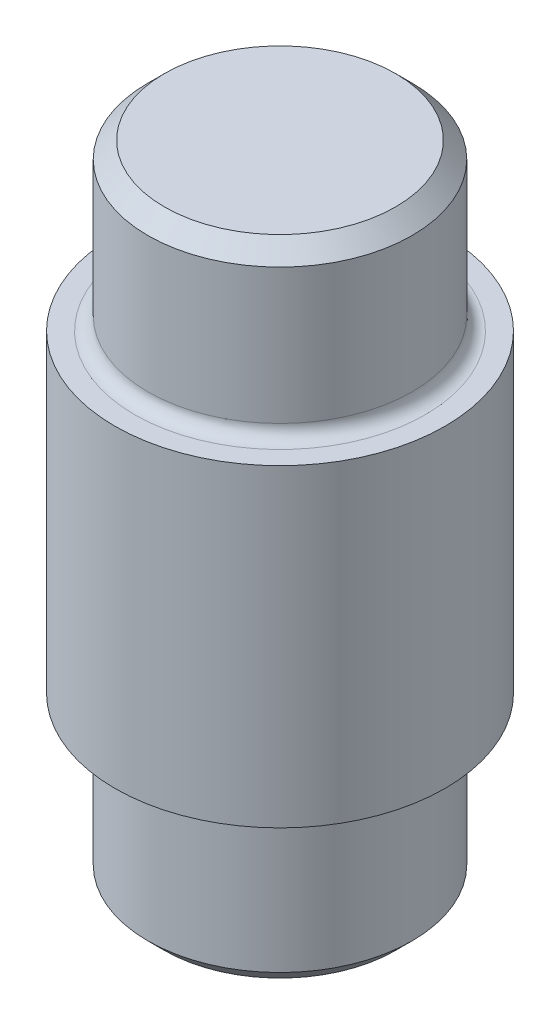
from build123d import *

# Parameters (mm, degrees)
CHANFREIN1_SIZE = 0.5
CONG_1_R        = 0.4


with BuildPart() as part:
    # Esquisse1 → Base-R_volution (revolve)
    with BuildSketch(Plane.XY, mode=Mode.PRIVATE) as base_r_volution_sk:
        Polygon((0, 0), (-4, 0), (-4, 5), (-5, 5), (-5, 14.5), (-4, 14.5), (-4, 19.5), (0, 19.5), align=None)
    revolve(base_r_volution_sk.sketch.rotate(Axis((0, 40, 0), (0, -1, 0)), 270), axis=Axis((0, 40, 0), (0, -1, 0)))

    # Chanfrein1
    chanfrein1_edges = [part.edges().sort_by_distance(p)[0] for p in [
        (0, 0, -4),
        (0, 19.5, -4),
    ]]
    chamfer(chanfrein1_edges, length=CHANFREIN1_SIZE)

    # Cong_1
    cong_1_edges = [part.edges().sort_by_distance(p)[0] for p in [
        (0, 5, -4),
        (0, 14.5, -4),
    ]]
    fillet(cong_1_edges, radius=CONG_1_R)


solid = part.part
